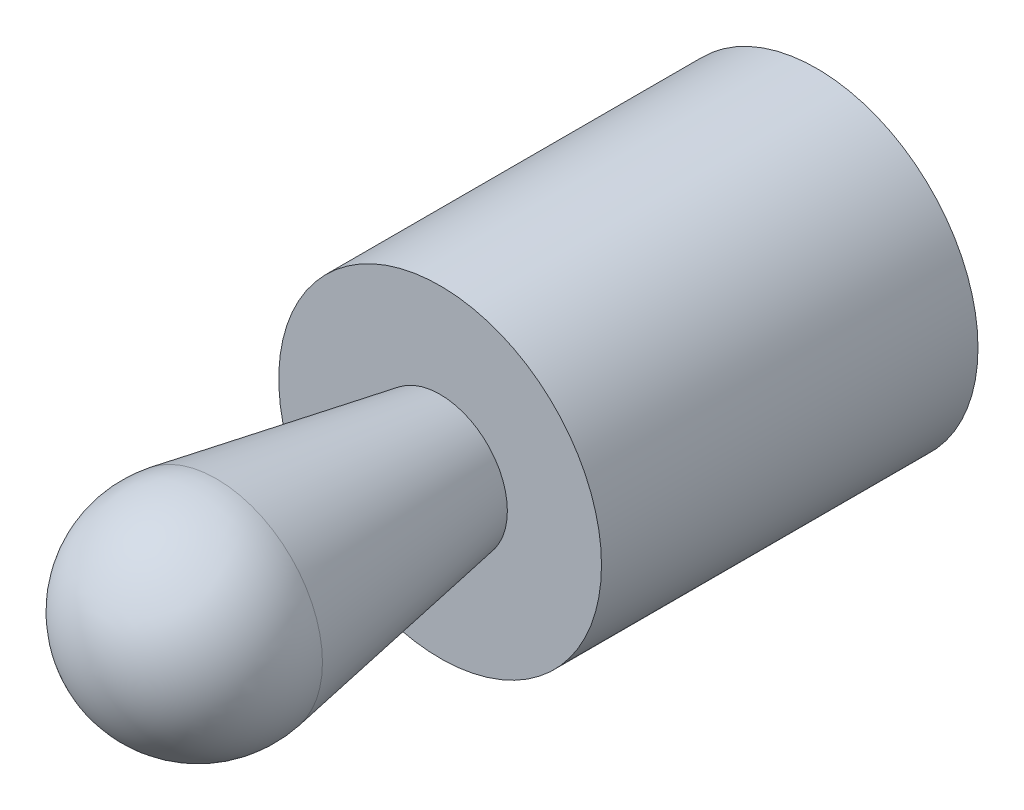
ISO-10303-21;
HEADER;
FILE_DESCRIPTION(('STEP AP214'),'2;1');
FILE_NAME('part.step','',(''),(''),'','','');
FILE_SCHEMA(('AUTOMOTIVE_DESIGN { 1 0 10303 214 1 1 1 1 }'));
ENDSEC;
DATA;
#1=APPLICATION_CONTEXT('core data for automotive mechanical design processes');
#2=APPLICATION_PROTOCOL_DEFINITION('international standard','automotive_design',2000,#1);
#3=PRODUCT_CONTEXT('',#1,'mechanical');
#4=PRODUCT('Part','Part','',(#3));
#5=PRODUCT_RELATED_PRODUCT_CATEGORY('part','',(#4));
#6=PRODUCT_DEFINITION_FORMATION('','',#4);
#7=PRODUCT_DEFINITION_CONTEXT('part definition',#1,'design');
#8=PRODUCT_DEFINITION('design','',#6,#7);
#9=PRODUCT_DEFINITION_SHAPE('','',#8);
#10=(LENGTH_UNIT() NAMED_UNIT(*) SI_UNIT(.MILLI.,.METRE.));
#11=(NAMED_UNIT(*) PLANE_ANGLE_UNIT() SI_UNIT($,.RADIAN.));
#12=(NAMED_UNIT(*) SI_UNIT($,.STERADIAN.) SOLID_ANGLE_UNIT());
#13=UNCERTAINTY_MEASURE_WITH_UNIT(LENGTH_MEASURE(1.E-05),#10,'distance_accuracy_value','');
#14=(GEOMETRIC_REPRESENTATION_CONTEXT(3) GLOBAL_UNCERTAINTY_ASSIGNED_CONTEXT((#13)) GLOBAL_UNIT_ASSIGNED_CONTEXT((#10,
#11,#12)) REPRESENTATION_CONTEXT('',''));
#15=CARTESIAN_POINT('',(0.,0.,0.));
#16=DIRECTION('',(0.,0.,1.));
#17=DIRECTION('',(1.,0.,0.));
#18=AXIS2_PLACEMENT_3D('',#15,#16,#17);
#19=CARTESIAN_POINT('',(0.,0.,0.));
#20=DIRECTION('',(0.,0.,1.));
#21=DIRECTION('',(1.,0.,0.));
#22=AXIS2_PLACEMENT_3D('',#19,#20,#21);
#23=PLANE('',#22);
#24=CARTESIAN_POINT('',(0.,0.,0.));
#25=DIRECTION('',(0.,0.,1.));
#26=DIRECTION('',(1.,0.,0.));
#27=AXIS2_PLACEMENT_3D('',#24,#25,#26);
#28=CIRCLE('',#27,6.);
#29=CARTESIAN_POINT('',(6.,0.,0.));
#30=VERTEX_POINT('',#29);
#31=EDGE_CURVE('E8',#30,#30,#28,.T.);
#32=ORIENTED_EDGE('',*,*,#31,.F.);
#33=EDGE_LOOP('',(#32));
#34=FACE_BOUND('',#33,.T.);
#35=ADVANCED_FACE('F12',(#34),#23,.F.);
#36=CARTESIAN_POINT('',(0.,0.,20.));
#37=DIRECTION('',(0.,0.,1.));
#38=DIRECTION('',(1.,0.,0.));
#39=AXIS2_PLACEMENT_3D('',#36,#37,#38);
#40=CYLINDRICAL_SURFACE('',#39,6.);
#41=CARTESIAN_POINT('',(0.,0.,14.));
#42=DIRECTION('',(0.,0.,1.));
#43=DIRECTION('',(1.,0.,0.));
#44=AXIS2_PLACEMENT_3D('',#41,#42,#43);
#45=CIRCLE('',#44,6.);
#46=CARTESIAN_POINT('',(6.,0.,14.));
#47=VERTEX_POINT('',#46);
#48=EDGE_CURVE('E18',#47,#47,#45,.T.);
#49=ORIENTED_EDGE('',*,*,#48,.F.);
#50=EDGE_LOOP('',(#49));
#51=FACE_BOUND('',#50,.T.);
#52=ORIENTED_EDGE('',*,*,#31,.T.);
#53=EDGE_LOOP('',(#52));
#54=FACE_BOUND('',#53,.T.);
#55=ADVANCED_FACE('F45',(#51,#54),#40,.T.);
#56=CARTESIAN_POINT('',(-2.5,0.,14.));
#57=DIRECTION('',(0.,0.,1.));
#58=DIRECTION('',(1.,0.,0.));
#59=AXIS2_PLACEMENT_3D('',#56,#57,#58);
#60=PLANE('',#59);
#61=ORIENTED_EDGE('',*,*,#48,.T.);
#62=EDGE_LOOP('',(#61));
#63=FACE_BOUND('',#62,.T.);
#64=CARTESIAN_POINT('',(0.,0.,14.));
#65=DIRECTION('',(0.,0.,1.));
#66=DIRECTION('',(1.,0.,0.));
#67=AXIS2_PLACEMENT_3D('',#64,#65,#66);
#68=CIRCLE('',#67,2.5);
#69=CARTESIAN_POINT('',(2.5,0.,14.));
#70=VERTEX_POINT('',#69);
#71=EDGE_CURVE('E22',#70,#70,#68,.T.);
#72=ORIENTED_EDGE('',*,*,#71,.F.);
#73=EDGE_LOOP('',(#72));
#74=FACE_BOUND('',#73,.T.);
#75=ADVANCED_FACE('F36',(#63,#74),#60,.T.);
#76=CARTESIAN_POINT('',(0.,0.,22.3170167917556));
#77=DIRECTION('',(0.,0.,1.));
#78=DIRECTION('',(1.,0.,0.));
#79=AXIS2_PLACEMENT_3D('',#76,#77,#78);
#80=CONICAL_SURFACE('',#79,3.94126045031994,0.171586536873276);
#81=ORIENTED_EDGE('',*,*,#71,.T.);
#82=EDGE_LOOP('',(#81));
#83=FACE_BOUND('',#82,.T.);
#84=CARTESIAN_POINT('',(0.,0.,22.3170167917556));
#85=DIRECTION('',(0.,0.,1.));
#86=DIRECTION('',(1.,0.,0.));
#87=AXIS2_PLACEMENT_3D('',#84,#85,#86);
#88=CIRCLE('',#87,3.94126045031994);
#89=CARTESIAN_POINT('',(3.94126045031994,0.,22.3170167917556));
#90=VERTEX_POINT('',#89);
#91=EDGE_CURVE('E26',#90,#90,#88,.T.);
#92=ORIENTED_EDGE('',*,*,#91,.F.);
#93=EDGE_LOOP('',(#92));
#94=FACE_BOUND('',#93,.T.);
#95=ADVANCED_FACE('F34',(#83,#94),#80,.T.);
#96=CARTESIAN_POINT('',(0.,0.,23.));
#97=DIRECTION('',(0.,0.,1.));
#98=DIRECTION('',(1.,0.,0.));
#99=AXIS2_PLACEMENT_3D('',#96,#97,#98);
#100=SPHERICAL_SURFACE('',#99,4.);
#101=ORIENTED_EDGE('',*,*,#91,.T.);
#102=EDGE_LOOP('',(#101));
#103=FACE_BOUND('',#102,.T.);
#104=ADVANCED_FACE('F32',(#103),#100,.T.);
#105=CLOSED_SHELL('',(#35,#55,#75,#95,#104));
#106=MANIFOLD_SOLID_BREP('B1',#105);
#107=ADVANCED_BREP_SHAPE_REPRESENTATION('',(#18,#106),#14);
#108=SHAPE_DEFINITION_REPRESENTATION(#9,#107);
ENDSEC;
END-ISO-10303-21;
